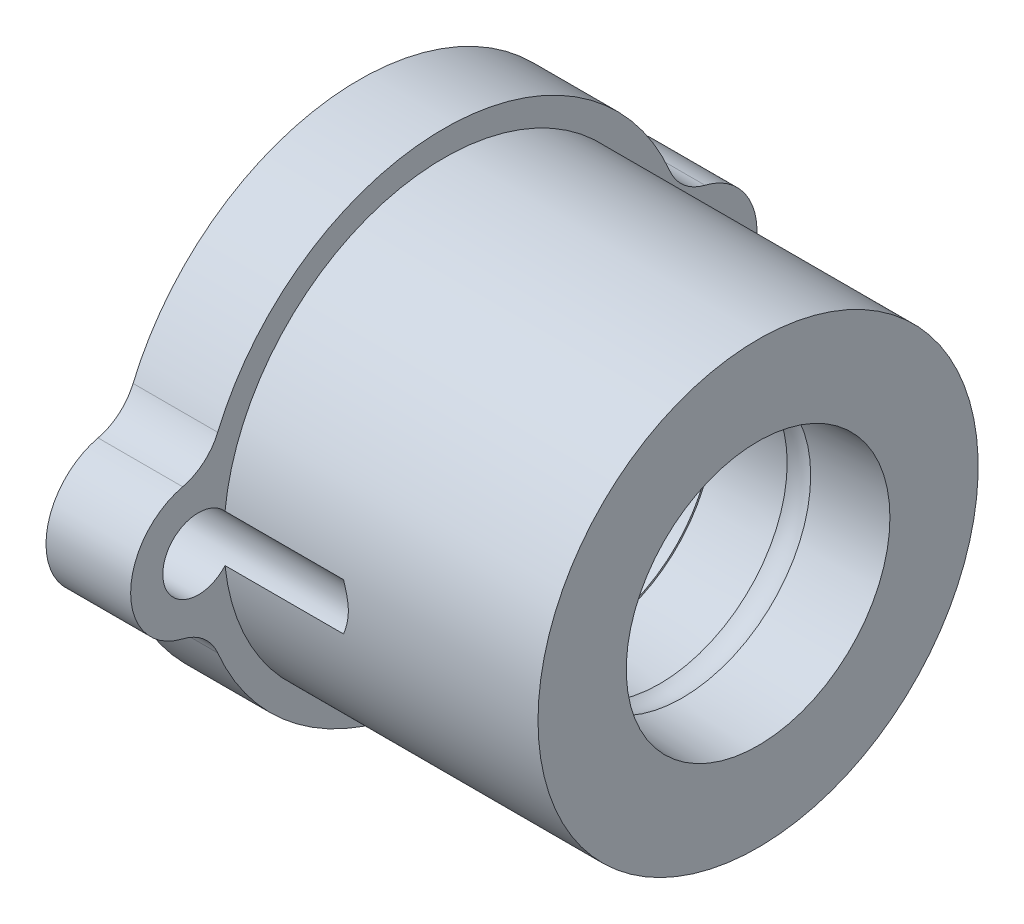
ISO-10303-21;
HEADER;
FILE_DESCRIPTION(('STEP AP214'),'2;1');
FILE_NAME('part.step','',(''),(''),'','','');
FILE_SCHEMA(('AUTOMOTIVE_DESIGN { 1 0 10303 214 1 1 1 1 }'));
ENDSEC;
DATA;
#1=APPLICATION_CONTEXT('core data for automotive mechanical design processes');
#2=APPLICATION_PROTOCOL_DEFINITION('international standard','automotive_design',2000,#1);
#3=PRODUCT_CONTEXT('',#1,'mechanical');
#4=PRODUCT('Part','Part','',(#3));
#5=PRODUCT_RELATED_PRODUCT_CATEGORY('part','',(#4));
#6=PRODUCT_DEFINITION_FORMATION('','',#4);
#7=PRODUCT_DEFINITION_CONTEXT('part definition',#1,'design');
#8=PRODUCT_DEFINITION('design','',#6,#7);
#9=PRODUCT_DEFINITION_SHAPE('','',#8);
#10=(LENGTH_UNIT() NAMED_UNIT(*) SI_UNIT(.MILLI.,.METRE.));
#11=(NAMED_UNIT(*) PLANE_ANGLE_UNIT() SI_UNIT($,.RADIAN.));
#12=(NAMED_UNIT(*) SI_UNIT($,.STERADIAN.) SOLID_ANGLE_UNIT());
#13=UNCERTAINTY_MEASURE_WITH_UNIT(LENGTH_MEASURE(1.E-05),#10,'distance_accuracy_value','');
#14=(GEOMETRIC_REPRESENTATION_CONTEXT(3) GLOBAL_UNCERTAINTY_ASSIGNED_CONTEXT((#13)) GLOBAL_UNIT_ASSIGNED_CONTEXT((#10,
#11,#12)) REPRESENTATION_CONTEXT('',''));
#15=CARTESIAN_POINT('',(0.,0.,0.));
#16=DIRECTION('',(0.,0.,1.));
#17=DIRECTION('',(1.,0.,0.));
#18=AXIS2_PLACEMENT_3D('',#15,#16,#17);
#19=CARTESIAN_POINT('',(0.,0.,0.));
#20=DIRECTION('',(-1.,0.,0.));
#21=DIRECTION('',(0.,0.,1.));
#22=AXIS2_PLACEMENT_3D('',#19,#20,#21);
#23=CYLINDRICAL_SURFACE('',#22,14.5);
#24=CARTESIAN_POINT('',(-13.5,0.,0.));
#25=DIRECTION('',(-1.,0.,0.));
#26=DIRECTION('',(0.,0.,1.));
#27=AXIS2_PLACEMENT_3D('',#24,#25,#26);
#28=CIRCLE('',#27,14.5);
#29=CARTESIAN_POINT('',(-13.5,-5.64240504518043,-13.3571428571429));
#30=VERTEX_POINT('',#29);
#31=CARTESIAN_POINT('',(-13.5,-5.64240504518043,13.3571428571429));
#32=VERTEX_POINT('',#31);
#33=EDGE_CURVE('E182',#30,#32,#28,.T.);
#34=ORIENTED_EDGE('',*,*,#33,.F.);
#35=DIRECTION('',(-1.,0.,0.));
#36=VECTOR('',#35,1.);
#37=CARTESIAN_POINT('',(0.,-5.64240504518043,-13.3571428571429));
#38=LINE('',#37,#36);
#39=CARTESIAN_POINT('',(-8.5,-5.64240504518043,-13.3571428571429));
#40=VERTEX_POINT('',#39);
#41=EDGE_CURVE('E138',#30,#40,#38,.F.);
#42=ORIENTED_EDGE('',*,*,#41,.T.);
#43=CARTESIAN_POINT('',(-8.5,0.,0.));
#44=DIRECTION('',(-1.,0.,0.));
#45=DIRECTION('',(0.,0.,1.));
#46=AXIS2_PLACEMENT_3D('',#43,#44,#45);
#47=CIRCLE('',#46,14.5);
#48=CARTESIAN_POINT('',(-8.5,-5.64240504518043,13.3571428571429));
#49=VERTEX_POINT('',#48);
#50=EDGE_CURVE('E183',#40,#49,#47,.T.);
#51=ORIENTED_EDGE('',*,*,#50,.T.);
#52=DIRECTION('',(-1.,0.,0.));
#53=VECTOR('',#52,1.);
#54=CARTESIAN_POINT('',(0.,-5.64240504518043,13.3571428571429));
#55=LINE('',#54,#53);
#56=EDGE_CURVE('E135',#49,#32,#55,.T.);
#57=ORIENTED_EDGE('',*,*,#56,.T.);
#58=EDGE_LOOP('',(#34,#42,#51,#57));
#59=FACE_BOUND('',#58,.T.);
#60=ADVANCED_FACE('F15',(#59),#23,.T.);
#61=CARTESIAN_POINT('',(-13.5,5.64240504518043,13.3571428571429));
#62=VERTEX_POINT('',#61);
#63=CARTESIAN_POINT('',(-13.5,5.64240504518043,-13.3571428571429));
#64=VERTEX_POINT('',#63);
#65=EDGE_CURVE('E163',#62,#64,#28,.T.);
#66=ORIENTED_EDGE('',*,*,#65,.F.);
#67=DIRECTION('',(-1.,0.,0.));
#68=VECTOR('',#67,1.);
#69=CARTESIAN_POINT('',(0.,5.64240504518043,13.3571428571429));
#70=LINE('',#69,#68);
#71=CARTESIAN_POINT('',(-8.5,5.64240504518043,13.3571428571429));
#72=VERTEX_POINT('',#71);
#73=EDGE_CURVE('E147',#62,#72,#70,.F.);
#74=ORIENTED_EDGE('',*,*,#73,.T.);
#75=CARTESIAN_POINT('',(-8.5,5.64240504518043,-13.3571428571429));
#76=VERTEX_POINT('',#75);
#77=EDGE_CURVE('E177',#72,#76,#47,.T.);
#78=ORIENTED_EDGE('',*,*,#77,.T.);
#79=DIRECTION('',(-1.,0.,0.));
#80=VECTOR('',#79,1.);
#81=CARTESIAN_POINT('',(0.,5.64240504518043,-13.3571428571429));
#82=LINE('',#81,#80);
#83=EDGE_CURVE('E145',#76,#64,#82,.T.);
#84=ORIENTED_EDGE('',*,*,#83,.T.);
#85=EDGE_LOOP('',(#66,#74,#78,#84));
#86=FACE_BOUND('',#85,.T.);
#87=ADVANCED_FACE('F180',(#86),#23,.T.);
#88=CARTESIAN_POINT('',(-13.5,21.,0.));
#89=DIRECTION('',(-1.,0.,0.));
#90=DIRECTION('',(0.,0.,1.));
#91=AXIS2_PLACEMENT_3D('',#88,#89,#90);
#92=PLANE('',#91);
#93=CARTESIAN_POINT('',(-13.5,0.,-14.5));
#94=DIRECTION('',(-1.,0.,0.));
#95=DIRECTION('',(0.,0.,1.));
#96=AXIS2_PLACEMENT_3D('',#93,#94,#95);
#97=CIRCLE('',#96,2.1);
#98=CARTESIAN_POINT('',(-13.5,0.,-12.4));
#99=VERTEX_POINT('',#98);
#100=EDGE_CURVE('E120',#99,#99,#97,.T.);
#101=ORIENTED_EDGE('',*,*,#100,.F.);
#102=EDGE_LOOP('',(#101));
#103=FACE_BOUND('',#102,.T.);
#104=CARTESIAN_POINT('',(-13.5,0.,14.5));
#105=DIRECTION('',(-1.,0.,0.));
#106=DIRECTION('',(0.,0.,1.));
#107=AXIS2_PLACEMENT_3D('',#104,#105,#106);
#108=CIRCLE('',#107,2.1);
#109=CARTESIAN_POINT('',(-13.5,0.,16.6));
#110=VERTEX_POINT('',#109);
#111=EDGE_CURVE('E315',#110,#110,#108,.T.);
#112=ORIENTED_EDGE('',*,*,#111,.F.);
#113=EDGE_LOOP('',(#112));
#114=FACE_BOUND('',#113,.T.);
#115=CARTESIAN_POINT('',(-13.5,0.,0.));
#116=DIRECTION('',(-1.,0.,0.));
#117=DIRECTION('',(0.,0.,1.));
#118=AXIS2_PLACEMENT_3D('',#115,#116,#117);
#119=CIRCLE('',#118,7.75);
#120=CARTESIAN_POINT('',(-13.5,0.,7.75));
#121=VERTEX_POINT('',#120);
#122=EDGE_CURVE('E209',#121,#121,#119,.T.);
#123=ORIENTED_EDGE('',*,*,#122,.F.);
#124=EDGE_LOOP('',(#123));
#125=FACE_BOUND('',#124,.T.);
#126=CARTESIAN_POINT('',(-13.5,0.,14.5));
#127=DIRECTION('',(-1.,0.,0.));
#128=DIRECTION('',(0.,0.,-1.));
#129=AXIS2_PLACEMENT_3D('',#126,#127,#128);
#130=CIRCLE('',#129,4.);
#131=CARTESIAN_POINT('',(-13.5,-3.89131382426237,15.4261083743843));
#132=VERTEX_POINT('',#131);
#133=CARTESIAN_POINT('',(-13.5,3.89131382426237,15.4261083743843));
#134=VERTEX_POINT('',#133);
#135=EDGE_CURVE('E305',#132,#134,#130,.T.);
#136=ORIENTED_EDGE('',*,*,#135,.T.);
#137=CARTESIAN_POINT('',(-13.5,6.80979919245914,16.1206896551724));
#138=DIRECTION('',(-1.,0.,0.));
#139=DIRECTION('',(0.,0.,1.));
#140=AXIS2_PLACEMENT_3D('',#137,#138,#139);
#141=CIRCLE('',#140,3.);
#142=EDGE_CURVE('E37',#134,#62,#141,.F.);
#143=ORIENTED_EDGE('',*,*,#142,.T.);
#144=ORIENTED_EDGE('',*,*,#65,.T.);
#145=CARTESIAN_POINT('',(-13.5,6.80979919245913,-16.1206896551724));
#146=DIRECTION('',(-1.,0.,0.));
#147=DIRECTION('',(0.,0.,1.));
#148=AXIS2_PLACEMENT_3D('',#145,#146,#147);
#149=CIRCLE('',#148,3.);
#150=CARTESIAN_POINT('',(-13.5,3.89131382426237,-15.4261083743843));
#151=VERTEX_POINT('',#150);
#152=EDGE_CURVE('E23',#64,#151,#149,.F.);
#153=ORIENTED_EDGE('',*,*,#152,.T.);
#154=CARTESIAN_POINT('',(-13.5,0.,-14.5));
#155=DIRECTION('',(1.,0.,0.));
#156=DIRECTION('',(0.,0.,1.));
#157=AXIS2_PLACEMENT_3D('',#154,#155,#156);
#158=CIRCLE('',#157,4.);
#159=CARTESIAN_POINT('',(-13.5,-3.89131382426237,-15.4261083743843));
#160=VERTEX_POINT('',#159);
#161=EDGE_CURVE('E162',#160,#151,#158,.T.);
#162=ORIENTED_EDGE('',*,*,#161,.F.);
#163=CARTESIAN_POINT('',(-13.5,-6.80979919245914,-16.1206896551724));
#164=DIRECTION('',(-1.,0.,0.));
#165=DIRECTION('',(0.,0.,1.));
#166=AXIS2_PLACEMENT_3D('',#163,#164,#165);
#167=CIRCLE('',#166,3.);
#168=EDGE_CURVE('E149',#160,#30,#167,.F.);
#169=ORIENTED_EDGE('',*,*,#168,.T.);
#170=ORIENTED_EDGE('',*,*,#33,.T.);
#171=CARTESIAN_POINT('',(-13.5,-6.80979919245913,16.1206896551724));
#172=DIRECTION('',(-1.,0.,0.));
#173=DIRECTION('',(0.,0.,1.));
#174=AXIS2_PLACEMENT_3D('',#171,#172,#173);
#175=CIRCLE('',#174,3.);
#176=EDGE_CURVE('E153',#32,#132,#175,.F.);
#177=ORIENTED_EDGE('',*,*,#176,.T.);
#178=EDGE_LOOP('',(#136,#143,#144,#153,#162,#169,#170,#177));
#179=FACE_BOUND('',#178,.T.);
#180=ADVANCED_FACE('F161',(#103,#114,#125,#179),#92,.T.);
#181=CARTESIAN_POINT('',(10.063,16.4852778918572,0.));
#182=DIRECTION('',(1.,0.,0.));
#183=DIRECTION('',(0.,0.,1.));
#184=AXIS2_PLACEMENT_3D('',#181,#182,#183);
#185=PLANE('',#184);
#186=CARTESIAN_POINT('',(10.063,0.,0.));
#187=DIRECTION('',(-1.,0.,0.));
#188=DIRECTION('',(0.,0.,-1.));
#189=AXIS2_PLACEMENT_3D('',#186,#187,#188);
#190=CIRCLE('',#189,7.7877);
#191=CARTESIAN_POINT('',(10.063,0.,-7.78769999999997));
#192=VERTEX_POINT('',#191);
#193=EDGE_CURVE('E195',#192,#192,#190,.T.);
#194=ORIENTED_EDGE('',*,*,#193,.T.);
#195=EDGE_LOOP('',(#194));
#196=FACE_BOUND('',#195,.T.);
#197=CARTESIAN_POINT('',(10.063,0.,0.));
#198=DIRECTION('',(-1.,0.,0.));
#199=DIRECTION('',(0.,0.,1.));
#200=AXIS2_PLACEMENT_3D('',#197,#198,#199);
#201=CIRCLE('',#200,13.);
#202=CARTESIAN_POINT('',(10.063,0.,13.));
#203=VERTEX_POINT('',#202);
#204=EDGE_CURVE('E304',#203,#203,#201,.T.);
#205=ORIENTED_EDGE('',*,*,#204,.F.);
#206=EDGE_LOOP('',(#205));
#207=FACE_BOUND('',#206,.T.);
#208=ADVANCED_FACE('F267',(#196,#207),#185,.T.);
#209=CARTESIAN_POINT('',(-13.5,0.,0.));
#210=DIRECTION('',(1.,0.,0.));
#211=DIRECTION('',(0.,0.,-1.));
#212=AXIS2_PLACEMENT_3D('',#209,#210,#211);
#213=CYLINDRICAL_SURFACE('',#212,7.25);
#214=CARTESIAN_POINT('',(-7.5,0.,0.));
#215=DIRECTION('',(-1.,0.,0.));
#216=DIRECTION('',(0.,0.,1.));
#217=AXIS2_PLACEMENT_3D('',#214,#215,#216);
#218=CIRCLE('',#217,7.25);
#219=CARTESIAN_POINT('',(-7.5,0.,7.25));
#220=VERTEX_POINT('',#219);
#221=EDGE_CURVE('E208',#220,#220,#218,.F.);
#222=ORIENTED_EDGE('',*,*,#221,.F.);
#223=EDGE_LOOP('',(#222));
#224=FACE_BOUND('',#223,.T.);
#225=CARTESIAN_POINT('',(0.0866,0.,0.));
#226=DIRECTION('',(1.,0.,0.));
#227=DIRECTION('',(0.,1.,0.));
#228=AXIS2_PLACEMENT_3D('',#225,#226,#227);
#229=CIRCLE('',#228,7.25);
#230=CARTESIAN_POINT('',(0.0866000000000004,7.25,0.));
#231=VERTEX_POINT('',#230);
#232=EDGE_CURVE('E204',#231,#231,#229,.F.);
#233=ORIENTED_EDGE('',*,*,#232,.F.);
#234=EDGE_LOOP('',(#233));
#235=FACE_BOUND('',#234,.T.);
#236=ADVANCED_FACE('F270',(#224,#235),#213,.F.);
#237=CARTESIAN_POINT('',(-7.5,0.,0.));
#238=DIRECTION('',(-1.,0.,0.));
#239=DIRECTION('',(0.,0.,1.));
#240=AXIS2_PLACEMENT_3D('',#237,#238,#239);
#241=PLANE('',#240);
#242=CARTESIAN_POINT('',(-7.5,0.,0.));
#243=DIRECTION('',(-1.,0.,0.));
#244=DIRECTION('',(0.,0.,1.));
#245=AXIS2_PLACEMENT_3D('',#242,#243,#244);
#246=CIRCLE('',#245,7.75);
#247=CARTESIAN_POINT('',(-7.5,0.,7.75));
#248=VERTEX_POINT('',#247);
#249=EDGE_CURVE('E205',#248,#248,#246,.T.);
#250=ORIENTED_EDGE('',*,*,#249,.T.);
#251=EDGE_LOOP('',(#250));
#252=FACE_BOUND('',#251,.T.);
#253=ORIENTED_EDGE('',*,*,#221,.T.);
#254=EDGE_LOOP('',(#253));
#255=FACE_BOUND('',#254,.T.);
#256=ADVANCED_FACE('F272',(#252,#255),#241,.T.);
#257=CARTESIAN_POINT('',(-7.5,0.,0.));
#258=DIRECTION('',(-1.,0.,0.));
#259=DIRECTION('',(0.,0.,1.));
#260=AXIS2_PLACEMENT_3D('',#257,#258,#259);
#261=CYLINDRICAL_SURFACE('',#260,7.75);
#262=ORIENTED_EDGE('',*,*,#249,.F.);
#263=EDGE_LOOP('',(#262));
#264=FACE_BOUND('',#263,.T.);
#265=ORIENTED_EDGE('',*,*,#122,.T.);
#266=EDGE_LOOP('',(#265));
#267=FACE_BOUND('',#266,.T.);
#268=ADVANCED_FACE('F262',(#264,#267),#261,.F.);
#269=CARTESIAN_POINT('',(0.0866,7.35212096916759,0.));
#270=DIRECTION('',(1.,0.,0.));
#271=DIRECTION('',(0.,0.,1.));
#272=AXIS2_PLACEMENT_3D('',#269,#270,#271);
#273=PLANE('',#272);
#274=CARTESIAN_POINT('',(0.0866,0.,0.));
#275=DIRECTION('',(-1.,0.,0.));
#276=DIRECTION('',(0.,0.,-1.));
#277=AXIS2_PLACEMENT_3D('',#274,#275,#276);
#278=CIRCLE('',#277,7.35212096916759);
#279=CARTESIAN_POINT('',(0.0865999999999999,0.,-7.35212096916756));
#280=VERTEX_POINT('',#279);
#281=EDGE_CURVE('E192',#280,#280,#278,.T.);
#282=ORIENTED_EDGE('',*,*,#281,.F.);
#283=EDGE_LOOP('',(#282));
#284=FACE_BOUND('',#283,.T.);
#285=ORIENTED_EDGE('',*,*,#232,.T.);
#286=EDGE_LOOP('',(#285));
#287=FACE_BOUND('',#286,.T.);
#288=ADVANCED_FACE('F259',(#284,#287),#273,.T.);
#289=CARTESIAN_POINT('',(10.063,0.,0.));
#290=DIRECTION('',(1.,0.,0.));
#291=DIRECTION('',(0.,0.,1.));
#292=AXIS2_PLACEMENT_3D('',#289,#290,#291);
#293=CONICAL_SURFACE('',#292,7.7877,0.0436332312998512);
#294=ORIENTED_EDGE('',*,*,#193,.F.);
#295=EDGE_LOOP('',(#294));
#296=FACE_BOUND('',#295,.T.);
#297=CARTESIAN_POINT('',(5.57802423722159,0.,0.));
#298=DIRECTION('',(-1.,0.,0.));
#299=DIRECTION('',(0.,0.,-1.));
#300=AXIS2_PLACEMENT_3D('',#297,#298,#299);
#301=CIRCLE('',#300,7.5918817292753);
#302=CARTESIAN_POINT('',(5.57802423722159,0.,-7.59188172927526));
#303=VERTEX_POINT('',#302);
#304=EDGE_CURVE('E198',#303,#303,#301,.T.);
#305=ORIENTED_EDGE('',*,*,#304,.T.);
#306=EDGE_LOOP('',(#305));
#307=FACE_BOUND('',#306,.T.);
#308=ADVANCED_FACE('F257',(#296,#307),#293,.F.);
#309=CARTESIAN_POINT('',(4.973,0.,0.));
#310=DIRECTION('',(1.,0.,0.));
#311=DIRECTION('',(0.,0.,1.));
#312=AXIS2_PLACEMENT_3D('',#309,#310,#311);
#313=TOROIDAL_SURFACE('',#312,6.18985652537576,1.527);
#314=ORIENTED_EDGE('',*,*,#304,.F.);
#315=EDGE_LOOP('',(#314));
#316=FACE_BOUND('',#315,.T.);
#317=CARTESIAN_POINT('',(4.24808351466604,0.,0.));
#318=DIRECTION('',(1.,0.,0.));
#319=DIRECTION('',(0.,0.,1.));
#320=AXIS2_PLACEMENT_3D('',#317,#318,#319);
#321=CIRCLE('',#320,7.53381526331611);
#322=CARTESIAN_POINT('',(4.24808351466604,0.,7.53381526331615));
#323=VERTEX_POINT('',#322);
#324=EDGE_CURVE('E201',#323,#323,#321,.T.);
#325=ORIENTED_EDGE('',*,*,#324,.F.);
#326=EDGE_LOOP('',(#325));
#327=FACE_BOUND('',#326,.T.);
#328=ADVANCED_FACE('F253',(#316,#327),#313,.F.);
#329=ORIENTED_EDGE('',*,*,#281,.T.);
#330=EDGE_LOOP('',(#329));
#331=FACE_BOUND('',#330,.T.);
#332=ORIENTED_EDGE('',*,*,#324,.T.);
#333=EDGE_LOOP('',(#332));
#334=FACE_BOUND('',#333,.T.);
#335=ADVANCED_FACE('F256',(#331,#334),#293,.F.);
#336=CARTESIAN_POINT('',(-8.5,0.,-14.5));
#337=DIRECTION('',(1.,0.,0.));
#338=DIRECTION('',(0.,0.,-1.));
#339=AXIS2_PLACEMENT_3D('',#336,#337,#338);
#340=PLANE('',#339);
#341=CARTESIAN_POINT('',(-8.5,0.,-14.5));
#342=DIRECTION('',(1.,0.,0.));
#343=DIRECTION('',(0.,0.,-1.));
#344=AXIS2_PLACEMENT_3D('',#341,#342,#343);
#345=CIRCLE('',#344,2.1);
#346=CARTESIAN_POINT('',(-8.5,-1.38960571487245,-12.9255172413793));
#347=VERTEX_POINT('',#346);
#348=CARTESIAN_POINT('',(-8.5,1.38960571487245,-12.9255172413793));
#349=VERTEX_POINT('',#348);
#350=EDGE_CURVE('E119',#347,#349,#345,.T.);
#351=ORIENTED_EDGE('',*,*,#350,.F.);
#352=CARTESIAN_POINT('',(-8.5,0.,0.));
#353=DIRECTION('',(-1.,0.,0.));
#354=DIRECTION('',(0.,0.,1.));
#355=AXIS2_PLACEMENT_3D('',#352,#353,#354);
#356=CIRCLE('',#355,13.);
#357=CARTESIAN_POINT('',(-8.5,-1.38960571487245,12.9255172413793));
#358=VERTEX_POINT('',#357);
#359=EDGE_CURVE('E126',#347,#358,#356,.T.);
#360=ORIENTED_EDGE('',*,*,#359,.T.);
#361=CARTESIAN_POINT('',(-8.5,0.,14.5));
#362=DIRECTION('',(1.,0.,0.));
#363=DIRECTION('',(0.,0.,-1.));
#364=AXIS2_PLACEMENT_3D('',#361,#362,#363);
#365=CIRCLE('',#364,2.1);
#366=CARTESIAN_POINT('',(-8.5,1.38960571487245,12.9255172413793));
#367=VERTEX_POINT('',#366);
#368=EDGE_CURVE('E170',#367,#358,#365,.T.);
#369=ORIENTED_EDGE('',*,*,#368,.F.);
#370=EDGE_CURVE('E188',#367,#349,#356,.T.);
#371=ORIENTED_EDGE('',*,*,#370,.T.);
#372=EDGE_LOOP('',(#351,#360,#369,#371));
#373=FACE_BOUND('',#372,.T.);
#374=ORIENTED_EDGE('',*,*,#77,.F.);
#375=CARTESIAN_POINT('',(-8.5,6.80979919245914,16.1206896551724));
#376=DIRECTION('',(1.,0.,0.));
#377=DIRECTION('',(0.,0.,-1.));
#378=AXIS2_PLACEMENT_3D('',#375,#376,#377);
#379=CIRCLE('',#378,3.);
#380=CARTESIAN_POINT('',(-8.5,3.89131382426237,15.4261083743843));
#381=VERTEX_POINT('',#380);
#382=EDGE_CURVE('E158',#72,#381,#379,.F.);
#383=ORIENTED_EDGE('',*,*,#382,.T.);
#384=CARTESIAN_POINT('',(-8.5,0.,14.5));
#385=DIRECTION('',(1.,0.,0.));
#386=DIRECTION('',(0.,0.,-1.));
#387=AXIS2_PLACEMENT_3D('',#384,#385,#386);
#388=CIRCLE('',#387,4.);
#389=CARTESIAN_POINT('',(-8.5,-3.89131382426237,15.4261083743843));
#390=VERTEX_POINT('',#389);
#391=EDGE_CURVE('E301',#390,#381,#388,.F.);
#392=ORIENTED_EDGE('',*,*,#391,.F.);
#393=CARTESIAN_POINT('',(-8.5,-6.80979919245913,16.1206896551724));
#394=DIRECTION('',(1.,0.,0.));
#395=DIRECTION('',(0.,0.,-1.));
#396=AXIS2_PLACEMENT_3D('',#393,#394,#395);
#397=CIRCLE('',#396,3.);
#398=EDGE_CURVE('E155',#390,#49,#397,.F.);
#399=ORIENTED_EDGE('',*,*,#398,.T.);
#400=ORIENTED_EDGE('',*,*,#50,.F.);
#401=CARTESIAN_POINT('',(-8.5,-6.80979919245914,-16.1206896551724));
#402=DIRECTION('',(1.,0.,0.));
#403=DIRECTION('',(0.,0.,-1.));
#404=AXIS2_PLACEMENT_3D('',#401,#402,#403);
#405=CIRCLE('',#404,3.);
#406=CARTESIAN_POINT('',(-8.5,-3.89131382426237,-15.4261083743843));
#407=VERTEX_POINT('',#406);
#408=EDGE_CURVE('E151',#40,#407,#405,.F.);
#409=ORIENTED_EDGE('',*,*,#408,.T.);
#410=CARTESIAN_POINT('',(-8.5,0.,-14.5));
#411=DIRECTION('',(1.,0.,0.));
#412=DIRECTION('',(0.,0.,-1.));
#413=AXIS2_PLACEMENT_3D('',#410,#411,#412);
#414=CIRCLE('',#413,4.);
#415=CARTESIAN_POINT('',(-8.5,3.89131382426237,-15.4261083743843));
#416=VERTEX_POINT('',#415);
#417=EDGE_CURVE('E169',#407,#416,#414,.T.);
#418=ORIENTED_EDGE('',*,*,#417,.T.);
#419=CARTESIAN_POINT('',(-8.5,6.80979919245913,-16.1206896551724));
#420=DIRECTION('',(1.,0.,0.));
#421=DIRECTION('',(0.,0.,-1.));
#422=AXIS2_PLACEMENT_3D('',#419,#420,#421);
#423=CIRCLE('',#422,3.);
#424=EDGE_CURVE('E10',#416,#76,#423,.F.);
#425=ORIENTED_EDGE('',*,*,#424,.T.);
#426=EDGE_LOOP('',(#374,#383,#392,#399,#400,#409,#418,#425));
#427=FACE_BOUND('',#426,.T.);
#428=ADVANCED_FACE('F176',(#373,#427),#340,.T.);
#429=CARTESIAN_POINT('',(0.,0.,0.));
#430=DIRECTION('',(-1.,0.,0.));
#431=DIRECTION('',(0.,0.,1.));
#432=AXIS2_PLACEMENT_3D('',#429,#430,#431);
#433=CYLINDRICAL_SURFACE('',#432,13.);
#434=DIRECTION('',(-1.,0.,0.));
#435=VECTOR('',#434,1.);
#436=CARTESIAN_POINT('',(-7.5,-1.38960571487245,-12.9255172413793));
#437=LINE('',#436,#435);
#438=CARTESIAN_POINT('',(-1.5,-1.38960571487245,-12.9255172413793));
#439=VERTEX_POINT('',#438);
#440=EDGE_CURVE('E117',#439,#347,#437,.T.);
#441=ORIENTED_EDGE('',*,*,#440,.F.);
#442=CARTESIAN_POINT('',(-1.5002,1.39005407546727,-12.9254690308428));
#443=CARTESIAN_POINT('',(-1.48083911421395,1.346645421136,-12.9301370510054));
#444=CARTESIAN_POINT('',(-1.46185679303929,1.30304684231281,-12.9346049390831));
#445=CARTESIAN_POINT('',(-1.42480586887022,1.21540834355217,-12.9431342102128));
#446=CARTESIAN_POINT('',(-1.40673755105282,1.17136829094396,-12.9471954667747));
#447=CARTESIAN_POINT('',(-1.35397204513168,1.0380685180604,-12.9587962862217));
#448=CARTESIAN_POINT('',(-1.32092146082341,0.948084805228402,-12.965703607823));
#449=CARTESIAN_POINT('',(-1.26145359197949,0.767056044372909,-12.9776634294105));
#450=CARTESIAN_POINT('',(-1.23495754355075,0.676038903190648,-12.9827383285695));
#451=CARTESIAN_POINT('',(-1.19051646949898,0.491968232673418,-12.9910130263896));
#452=CARTESIAN_POINT('',(-1.17255363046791,0.398919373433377,-12.9942167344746));
#453=CARTESIAN_POINT('',(-1.14997750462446,0.229562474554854,-12.9981926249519));
#454=CARTESIAN_POINT('',(-1.14344558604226,0.153523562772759,-12.9993168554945));
#455=CARTESIAN_POINT('',(-1.13819195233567,0.00114917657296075,-13.0002230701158));
#456=CARTESIAN_POINT('',(-1.13947082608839,-0.0751863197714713,-13.0000049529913));
#457=CARTESIAN_POINT('',(-1.14969494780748,-0.227401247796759,-12.9982342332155));
#458=CARTESIAN_POINT('',(-1.158649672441,-0.303279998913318,-12.9966799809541));
#459=CARTESIAN_POINT('',(-1.18327002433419,-0.45389402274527,-12.9922924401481));
#460=CARTESIAN_POINT('',(-1.19893777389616,-0.528628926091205,-12.9894587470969));
#461=CARTESIAN_POINT('',(-1.23416898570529,-0.67063140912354,-12.982869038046));
#462=CARTESIAN_POINT('',(-1.25331041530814,-0.738010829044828,-12.979207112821));
#463=CARTESIAN_POINT('',(-1.29517317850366,-0.871582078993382,-12.9709221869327));
#464=CARTESIAN_POINT('',(-1.31789491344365,-0.937773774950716,-12.9662990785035));
#465=CARTESIAN_POINT('',(-1.36603427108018,-1.06889607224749,-12.9561482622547));
#466=CARTESIAN_POINT('',(-1.39144500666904,-1.13382941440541,-12.9506228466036));
#467=CARTESIAN_POINT('',(-1.44438133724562,-1.26266341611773,-12.9386958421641));
#468=CARTESIAN_POINT('',(-1.47190449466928,-1.32656516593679,-12.9322952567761));
#469=CARTESIAN_POINT('',(-1.5002,-1.39005407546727,-12.9254690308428));
#470=B_SPLINE_CURVE_WITH_KNOTS('',3,(#442,#443,#444,#445,#446,#447,#448,#449,#450,#451,#452,
#453,#454,#455,#456,#457,#458,#459,#460,#461,#462,#463,#464,#465,#466,#467,#468,#469),
.UNSPECIFIED.,.F.,.F.,(4,2,2,2,2,2,2,2,2,2,2,2,2,4),(0.,0.143272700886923,0.286589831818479,
0.574731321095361,0.859220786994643,1.14311373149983,1.37171436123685,1.60033222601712,
1.82923275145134,2.05820569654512,2.26850091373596,2.47881972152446,2.6886123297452,
2.89816639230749),.UNSPECIFIED.);
#471=CARTESIAN_POINT('',(-1.5,1.38960571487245,-12.9255172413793));
#472=VERTEX_POINT('',#471);
#473=EDGE_CURVE('E103',#472,#439,#470,.T.);
#474=ORIENTED_EDGE('',*,*,#473,.F.);
#475=DIRECTION('',(-1.,0.,0.));
#476=VECTOR('',#475,1.);
#477=CARTESIAN_POINT('',(-7.5,1.38960571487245,-12.9255172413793));
#478=LINE('',#477,#476);
#479=EDGE_CURVE('E111',#349,#472,#478,.F.);
#480=ORIENTED_EDGE('',*,*,#479,.F.);
#481=ORIENTED_EDGE('',*,*,#370,.F.);
#482=DIRECTION('',(-1.,0.,0.));
#483=VECTOR('',#482,1.);
#484=CARTESIAN_POINT('',(-7.5,1.38960571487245,12.9255172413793));
#485=LINE('',#484,#483);
#486=CARTESIAN_POINT('',(-1.5,1.38960571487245,12.9255172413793));
#487=VERTEX_POINT('',#486);
#488=EDGE_CURVE('E112',#487,#367,#485,.T.);
#489=ORIENTED_EDGE('',*,*,#488,.F.);
#490=CARTESIAN_POINT('',(-1.5002,-1.39005407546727,12.9254690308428));
#491=CARTESIAN_POINT('',(-1.48083911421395,-1.346645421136,12.9301370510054));
#492=CARTESIAN_POINT('',(-1.46185679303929,-1.30304684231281,12.9346049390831));
#493=CARTESIAN_POINT('',(-1.42480586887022,-1.21540834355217,12.9431342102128));
#494=CARTESIAN_POINT('',(-1.40673755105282,-1.17136829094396,12.9471954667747));
#495=CARTESIAN_POINT('',(-1.35397204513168,-1.0380685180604,12.9587962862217));
#496=CARTESIAN_POINT('',(-1.32092146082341,-0.948084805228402,12.965703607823));
#497=CARTESIAN_POINT('',(-1.26145359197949,-0.767056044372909,12.9776634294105));
#498=CARTESIAN_POINT('',(-1.23495754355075,-0.676038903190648,12.9827383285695));
#499=CARTESIAN_POINT('',(-1.19051646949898,-0.491968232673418,12.9910130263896));
#500=CARTESIAN_POINT('',(-1.17255363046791,-0.398919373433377,12.9942167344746));
#501=CARTESIAN_POINT('',(-1.14997750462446,-0.229562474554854,12.9981926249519));
#502=CARTESIAN_POINT('',(-1.14344558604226,-0.153523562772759,12.9993168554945));
#503=CARTESIAN_POINT('',(-1.13819195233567,-0.00114917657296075,13.0002230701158));
#504=CARTESIAN_POINT('',(-1.13947082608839,0.0751863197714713,13.0000049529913));
#505=CARTESIAN_POINT('',(-1.14969494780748,0.227401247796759,12.9982342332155));
#506=CARTESIAN_POINT('',(-1.158649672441,0.303279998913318,12.9966799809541));
#507=CARTESIAN_POINT('',(-1.18327002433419,0.45389402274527,12.9922924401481));
#508=CARTESIAN_POINT('',(-1.19893777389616,0.528628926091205,12.9894587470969));
#509=CARTESIAN_POINT('',(-1.23416898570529,0.67063140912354,12.982869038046));
#510=CARTESIAN_POINT('',(-1.25331041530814,0.738010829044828,12.979207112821));
#511=CARTESIAN_POINT('',(-1.29517317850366,0.871582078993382,12.9709221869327));
#512=CARTESIAN_POINT('',(-1.31789491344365,0.937773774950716,12.9662990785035));
#513=CARTESIAN_POINT('',(-1.36603427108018,1.06889607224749,12.9561482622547));
#514=CARTESIAN_POINT('',(-1.39144500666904,1.13382941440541,12.9506228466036));
#515=CARTESIAN_POINT('',(-1.44438133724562,1.26266341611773,12.9386958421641));
#516=CARTESIAN_POINT('',(-1.47190449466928,1.32656516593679,12.9322952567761));
#517=CARTESIAN_POINT('',(-1.5002,1.39005407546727,12.9254690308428));
#518=B_SPLINE_CURVE_WITH_KNOTS('',3,(#490,#491,#492,#493,#494,#495,#496,#497,#498,#499,#500,
#501,#502,#503,#504,#505,#506,#507,#508,#509,#510,#511,#512,#513,#514,#515,#516,#517),
.UNSPECIFIED.,.F.,.F.,(4,2,2,2,2,2,2,2,2,2,2,2,2,4),(0.,0.143272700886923,0.286589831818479,
0.574731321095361,0.859220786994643,1.14311373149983,1.37171436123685,1.60033222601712,
1.82923275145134,2.05820569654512,2.26850091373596,2.47881972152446,2.6886123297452,
2.89816639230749),.UNSPECIFIED.);
#519=CARTESIAN_POINT('',(-1.5,-1.38960571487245,12.9255172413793));
#520=VERTEX_POINT('',#519);
#521=EDGE_CURVE('E214',#520,#487,#518,.T.);
#522=ORIENTED_EDGE('',*,*,#521,.F.);
#523=DIRECTION('',(-1.,0.,0.));
#524=VECTOR('',#523,1.);
#525=CARTESIAN_POINT('',(-7.5,-1.38960571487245,12.9255172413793));
#526=LINE('',#525,#524);
#527=EDGE_CURVE('E223',#358,#520,#526,.F.);
#528=ORIENTED_EDGE('',*,*,#527,.F.);
#529=ORIENTED_EDGE('',*,*,#359,.F.);
#530=EDGE_LOOP('',(#441,#474,#480,#481,#489,#522,#528,#529));
#531=FACE_BOUND('',#530,.T.);
#532=ORIENTED_EDGE('',*,*,#204,.T.);
#533=EDGE_LOOP('',(#532));
#534=FACE_BOUND('',#533,.T.);
#535=ADVANCED_FACE('F123',(#531,#534),#433,.T.);
#536=CARTESIAN_POINT('',(0.704248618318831,0.,14.5));
#537=DIRECTION('',(-1.,0.,0.));
#538=DIRECTION('',(0.,0.,1.));
#539=AXIS2_PLACEMENT_3D('',#536,#537,#538);
#540=CYLINDRICAL_SURFACE('',#539,4.);
#541=ORIENTED_EDGE('',*,*,#135,.F.);
#542=DIRECTION('',(-1.,0.,0.));
#543=VECTOR('',#542,1.);
#544=CARTESIAN_POINT('',(0.704248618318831,-3.89131382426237,15.4261083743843));
#545=LINE('',#544,#543);
#546=EDGE_CURVE('E143',#132,#390,#545,.F.);
#547=ORIENTED_EDGE('',*,*,#546,.T.);
#548=ORIENTED_EDGE('',*,*,#391,.T.);
#549=DIRECTION('',(-1.,0.,0.));
#550=VECTOR('',#549,1.);
#551=CARTESIAN_POINT('',(0.704248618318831,3.89131382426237,15.4261083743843));
#552=LINE('',#551,#550);
#553=EDGE_CURVE('E140',#381,#134,#552,.T.);
#554=ORIENTED_EDGE('',*,*,#553,.T.);
#555=EDGE_LOOP('',(#541,#547,#548,#554));
#556=FACE_BOUND('',#555,.T.);
#557=ADVANCED_FACE('F237',(#556),#540,.T.);
#558=CARTESIAN_POINT('',(0.704248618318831,0.,-14.5));
#559=DIRECTION('',(-1.,0.,0.));
#560=DIRECTION('',(0.,0.,1.));
#561=AXIS2_PLACEMENT_3D('',#558,#559,#560);
#562=CYLINDRICAL_SURFACE('',#561,4.);
#563=ORIENTED_EDGE('',*,*,#417,.F.);
#564=DIRECTION('',(-1.,0.,0.));
#565=VECTOR('',#564,1.);
#566=CARTESIAN_POINT('',(0.704248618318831,-3.89131382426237,-15.4261083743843));
#567=LINE('',#566,#565);
#568=EDGE_CURVE('E129',#407,#160,#567,.T.);
#569=ORIENTED_EDGE('',*,*,#568,.T.);
#570=ORIENTED_EDGE('',*,*,#161,.T.);
#571=DIRECTION('',(-1.,0.,0.));
#572=VECTOR('',#571,1.);
#573=CARTESIAN_POINT('',(0.704248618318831,3.89131382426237,-15.4261083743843));
#574=LINE('',#573,#572);
#575=EDGE_CURVE('E127',#151,#416,#574,.F.);
#576=ORIENTED_EDGE('',*,*,#575,.T.);
#577=EDGE_LOOP('',(#563,#569,#570,#576));
#578=FACE_BOUND('',#577,.T.);
#579=ADVANCED_FACE('F166',(#578),#562,.T.);
#580=CARTESIAN_POINT('',(-1.5,0.,14.5));
#581=DIRECTION('',(-1.,0.,0.));
#582=DIRECTION('',(0.,0.,1.));
#583=AXIS2_PLACEMENT_3D('',#580,#581,#582);
#584=CONICAL_SURFACE('',#583,2.1,1.02974425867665);
#585=ORIENTED_EDGE('',*,*,#521,.T.);
#586=CARTESIAN_POINT('',(-1.5,0.,14.5));
#587=DIRECTION('',(-1.,0.,0.));
#588=DIRECTION('',(0.,0.,1.));
#589=AXIS2_PLACEMENT_3D('',#586,#587,#588);
#590=CIRCLE('',#589,2.1);
#591=EDGE_CURVE('E313',#487,#520,#590,.T.);
#592=ORIENTED_EDGE('',*,*,#591,.T.);
#593=EDGE_LOOP('',(#585,#592));
#594=FACE_BOUND('',#593,.T.);
#595=ADVANCED_FACE('F228',(#594),#584,.F.);
#596=CARTESIAN_POINT('',(-13.5,0.,14.5));
#597=DIRECTION('',(-1.,0.,0.));
#598=DIRECTION('',(0.,0.,1.));
#599=AXIS2_PLACEMENT_3D('',#596,#597,#598);
#600=CYLINDRICAL_SURFACE('',#599,2.1);
#601=ORIENTED_EDGE('',*,*,#488,.T.);
#602=ORIENTED_EDGE('',*,*,#368,.T.);
#603=ORIENTED_EDGE('',*,*,#527,.T.);
#604=ORIENTED_EDGE('',*,*,#591,.F.);
#605=EDGE_LOOP('',(#601,#602,#603,#604));
#606=FACE_BOUND('',#605,.T.);
#607=ORIENTED_EDGE('',*,*,#111,.T.);
#608=EDGE_LOOP('',(#607));
#609=FACE_BOUND('',#608,.T.);
#610=ADVANCED_FACE('F233',(#606,#609),#600,.F.);
#611=CARTESIAN_POINT('',(-1.5,0.,-14.5));
#612=DIRECTION('',(-1.,0.,0.));
#613=DIRECTION('',(0.,0.,1.));
#614=AXIS2_PLACEMENT_3D('',#611,#612,#613);
#615=CONICAL_SURFACE('',#614,2.1,1.02974425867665);
#616=ORIENTED_EDGE('',*,*,#473,.T.);
#617=CARTESIAN_POINT('',(-1.5,0.,-14.5));
#618=DIRECTION('',(-1.,0.,0.));
#619=DIRECTION('',(0.,0.,1.));
#620=AXIS2_PLACEMENT_3D('',#617,#618,#619);
#621=CIRCLE('',#620,2.1);
#622=EDGE_CURVE('E106',#439,#472,#621,.T.);
#623=ORIENTED_EDGE('',*,*,#622,.T.);
#624=EDGE_LOOP('',(#616,#623));
#625=FACE_BOUND('',#624,.T.);
#626=ADVANCED_FACE('F105',(#625),#615,.F.);
#627=CARTESIAN_POINT('',(-13.5,0.,-14.5));
#628=DIRECTION('',(-1.,0.,0.));
#629=DIRECTION('',(0.,0.,1.));
#630=AXIS2_PLACEMENT_3D('',#627,#628,#629);
#631=CYLINDRICAL_SURFACE('',#630,2.1);
#632=ORIENTED_EDGE('',*,*,#440,.T.);
#633=ORIENTED_EDGE('',*,*,#350,.T.);
#634=ORIENTED_EDGE('',*,*,#479,.T.);
#635=ORIENTED_EDGE('',*,*,#622,.F.);
#636=EDGE_LOOP('',(#632,#633,#634,#635));
#637=FACE_BOUND('',#636,.T.);
#638=ORIENTED_EDGE('',*,*,#100,.T.);
#639=EDGE_LOOP('',(#638));
#640=FACE_BOUND('',#639,.T.);
#641=ADVANCED_FACE('F115',(#637,#640),#631,.F.);
#642=CARTESIAN_POINT('',(0.,-6.80979919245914,-16.1206896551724));
#643=DIRECTION('',(1.,0.,0.));
#644=DIRECTION('',(0.,0.,-1.));
#645=AXIS2_PLACEMENT_3D('',#642,#643,#644);
#646=CYLINDRICAL_SURFACE('',#645,3.);
#647=ORIENTED_EDGE('',*,*,#408,.F.);
#648=ORIENTED_EDGE('',*,*,#41,.F.);
#649=ORIENTED_EDGE('',*,*,#168,.F.);
#650=ORIENTED_EDGE('',*,*,#568,.F.);
#651=EDGE_LOOP('',(#647,#648,#649,#650));
#652=FACE_BOUND('',#651,.T.);
#653=ADVANCED_FACE('F285',(#652),#646,.F.);
#654=CARTESIAN_POINT('',(0.704248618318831,-6.80979919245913,16.1206896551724));
#655=DIRECTION('',(1.,0.,0.));
#656=DIRECTION('',(0.,0.,-1.));
#657=AXIS2_PLACEMENT_3D('',#654,#655,#656);
#658=CYLINDRICAL_SURFACE('',#657,3.);
#659=ORIENTED_EDGE('',*,*,#398,.F.);
#660=ORIENTED_EDGE('',*,*,#546,.F.);
#661=ORIENTED_EDGE('',*,*,#176,.F.);
#662=ORIENTED_EDGE('',*,*,#56,.F.);
#663=EDGE_LOOP('',(#659,#660,#661,#662));
#664=FACE_BOUND('',#663,.T.);
#665=ADVANCED_FACE('F288',(#664),#658,.F.);
#666=CARTESIAN_POINT('',(0.,6.80979919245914,16.1206896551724));
#667=DIRECTION('',(1.,0.,0.));
#668=DIRECTION('',(0.,0.,-1.));
#669=AXIS2_PLACEMENT_3D('',#666,#667,#668);
#670=CYLINDRICAL_SURFACE('',#669,3.);
#671=ORIENTED_EDGE('',*,*,#382,.F.);
#672=ORIENTED_EDGE('',*,*,#73,.F.);
#673=ORIENTED_EDGE('',*,*,#142,.F.);
#674=ORIENTED_EDGE('',*,*,#553,.F.);
#675=EDGE_LOOP('',(#671,#672,#673,#674));
#676=FACE_BOUND('',#675,.T.);
#677=ADVANCED_FACE('F291',(#676),#670,.F.);
#678=CARTESIAN_POINT('',(0.704248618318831,6.80979919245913,-16.1206896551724));
#679=DIRECTION('',(1.,0.,0.));
#680=DIRECTION('',(0.,0.,-1.));
#681=AXIS2_PLACEMENT_3D('',#678,#679,#680);
#682=CYLINDRICAL_SURFACE('',#681,3.);
#683=ORIENTED_EDGE('',*,*,#424,.F.);
#684=ORIENTED_EDGE('',*,*,#575,.F.);
#685=ORIENTED_EDGE('',*,*,#152,.F.);
#686=ORIENTED_EDGE('',*,*,#83,.F.);
#687=EDGE_LOOP('',(#683,#684,#685,#686));
#688=FACE_BOUND('',#687,.T.);
#689=ADVANCED_FACE('F17',(#688),#682,.F.);
#690=CLOSED_SHELL('',(#60,#87,#180,#208,#236,#256,#268,#288,#308,#328,#335,#428,#535,#557,#579,
#595,#610,#626,#641,#653,#665,#677,#689));
#691=MANIFOLD_SOLID_BREP('B1',#690);
#692=ADVANCED_BREP_SHAPE_REPRESENTATION('',(#18,#691),#14);
#693=SHAPE_DEFINITION_REPRESENTATION(#9,#692);
ENDSEC;
END-ISO-10303-21;
